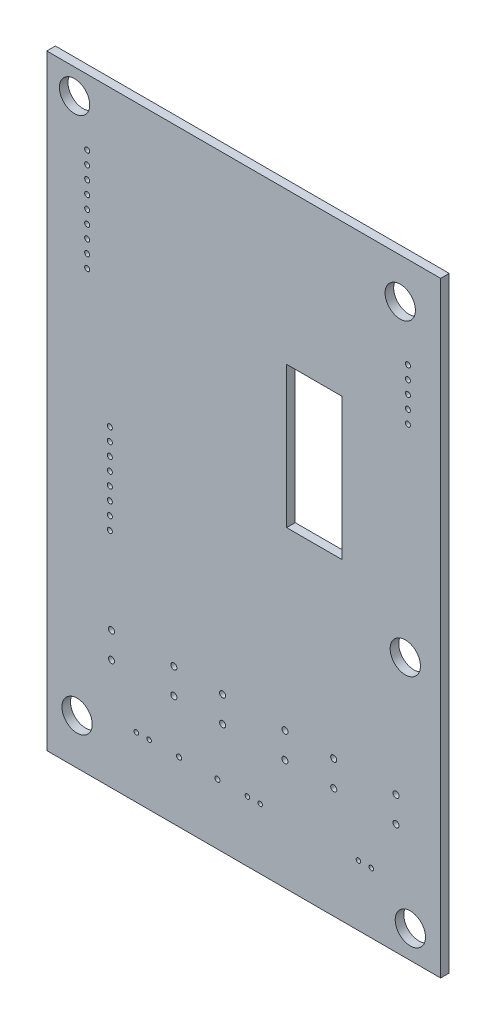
from build123d import *

# Parameters (mm, degrees)
ESQUISSE2_W        = 78
ESQUISSE2_H        = 120
ESQUISSE2_R        = 3
ESQUISSE2_R_2      = 0.5
ESQUISSE2_R_3      = 0.6
ESQUISSE2_R_4      = 0.45
ESQUISSE2_W_2      = 11
ESQUISSE2_H_2      = 28
BOSS_EXTRU_1_DEPTH = 1.7


with BuildPart() as part:
    # Esquisse2 → Boss.-Extru.1 (new body)
    with BuildSketch(Plane.XY):
        with Locations((66, -83)):
            Rectangle(ESQUISSE2_W, ESQUISSE2_H)
        with Locations((97, -31)):
            Circle(ESQUISSE2_R, mode=Mode.SUBTRACT)
        with Locations((98.52, -41.08)):
            Circle(ESQUISSE2_R_2, mode=Mode.SUBTRACT)
        with Locations((98.52, -43.62)):
            Circle(ESQUISSE2_R_2, mode=Mode.SUBTRACT)
        with Locations((98.52, -46.16)):
            Circle(ESQUISSE2_R_2, mode=Mode.SUBTRACT)
        with Locations((98.52, -48.7)):
            Circle(ESQUISSE2_R_2, mode=Mode.SUBTRACT)
        with Locations((98.52, -51.24)):
            Circle(ESQUISSE2_R_2, mode=Mode.SUBTRACT)
        with Locations((32.5, -28)):
            Circle(ESQUISSE2_R, mode=Mode.SUBTRACT)
        with Locations((35, -36)):
            Circle(ESQUISSE2_R_2, mode=Mode.SUBTRACT)
        with Locations((35, -38.54)):
            Circle(ESQUISSE2_R_2, mode=Mode.SUBTRACT)
        with Locations((35, -41.08)):
            Circle(ESQUISSE2_R_2, mode=Mode.SUBTRACT)
        with Locations((35, -43.62)):
            Circle(ESQUISSE2_R_2, mode=Mode.SUBTRACT)
        with Locations((35, -46.16)):
            Circle(ESQUISSE2_R_2, mode=Mode.SUBTRACT)
        with Locations((35, -48.7)):
            Circle(ESQUISSE2_R_2, mode=Mode.SUBTRACT)
        with Locations((35, -51.24)):
            Circle(ESQUISSE2_R_2, mode=Mode.SUBTRACT)
        with Locations((35, -53.78)):
            Circle(ESQUISSE2_R_2, mode=Mode.SUBTRACT)
        with Locations((35, -56.32)):
            Circle(ESQUISSE2_R_2, mode=Mode.SUBTRACT)
        with Locations((39.49, -81.21)):
            Circle(ESQUISSE2_R_2, mode=Mode.SUBTRACT)
        with Locations((98, -91.5)):
            Circle(ESQUISSE2_R, mode=Mode.SUBTRACT)
        with Locations((96.17, -115.96)):
            Circle(ESQUISSE2_R_3, mode=Mode.SUBTRACT)
        with Locations((96.16, -121.04)):
            Circle(ESQUISSE2_R_3, mode=Mode.SUBTRACT)
        with Locations((99, -137.5)):
            Circle(ESQUISSE2_R, mode=Mode.SUBTRACT)
        with Locations((91.265, -131)):
            Circle(ESQUISSE2_R_4, mode=Mode.SUBTRACT)
        with Locations((88.725, -131)):
            Circle(ESQUISSE2_R_4, mode=Mode.SUBTRACT)
        with Locations((83.82, -115.95)):
            Circle(ESQUISSE2_R_3, mode=Mode.SUBTRACT)
        with Locations((83.83, -121.04)):
            Circle(ESQUISSE2_R_3, mode=Mode.SUBTRACT)
        with Locations((74.17, -115.96)):
            Circle(ESQUISSE2_R_3, mode=Mode.SUBTRACT)
        with Locations((74.16, -121.04)):
            Circle(ESQUISSE2_R_3, mode=Mode.SUBTRACT)
        with Locations((69.265, -131)):
            Circle(ESQUISSE2_R_4, mode=Mode.SUBTRACT)
        with Locations((66.725, -131)):
            Circle(ESQUISSE2_R_4, mode=Mode.SUBTRACT)
        with Locations((39.49, -83.75)):
            Circle(ESQUISSE2_R_2, mode=Mode.SUBTRACT)
        with Locations((39.49, -86.29)):
            Circle(ESQUISSE2_R_2, mode=Mode.SUBTRACT)
        with Locations((39.49, -88.83)):
            Circle(ESQUISSE2_R_2, mode=Mode.SUBTRACT)
        with Locations((39.49, -91.37)):
            Circle(ESQUISSE2_R_2, mode=Mode.SUBTRACT)
        with Locations((39.49, -93.91)):
            Circle(ESQUISSE2_R_2, mode=Mode.SUBTRACT)
        with Locations((39.49, -96.45)):
            Circle(ESQUISSE2_R_2, mode=Mode.SUBTRACT)
        with Locations((39.49, -98.99)):
            Circle(ESQUISSE2_R_2, mode=Mode.SUBTRACT)
        with Locations((61.82, -115.95)):
            Circle(ESQUISSE2_R_3, mode=Mode.SUBTRACT)
        with Locations((61.83, -121.04)):
            Circle(ESQUISSE2_R_3, mode=Mode.SUBTRACT)
        with Locations((52.17, -115.96)):
            Circle(ESQUISSE2_R_3, mode=Mode.SUBTRACT)
        with Locations((52.16, -121.04)):
            Circle(ESQUISSE2_R_3, mode=Mode.SUBTRACT)
        with Locations((60.8, -131)):
            Circle(ESQUISSE2_R_2, mode=Mode.SUBTRACT)
        with Locations((53.2, -131)):
            Circle(ESQUISSE2_R_2, mode=Mode.SUBTRACT)
        with Locations((39.82, -115.95)):
            Circle(ESQUISSE2_R_3, mode=Mode.SUBTRACT)
        with Locations((39.83, -121.04)):
            Circle(ESQUISSE2_R_3, mode=Mode.SUBTRACT)
        with Locations((47.265, -131)):
            Circle(ESQUISSE2_R_4, mode=Mode.SUBTRACT)
        with Locations((44.725, -131)):
            Circle(ESQUISSE2_R_4, mode=Mode.SUBTRACT)
        with Locations((33, -134)):
            Circle(ESQUISSE2_R, mode=Mode.SUBTRACT)
        with Locations((80, -67)):
            Rectangle(ESQUISSE2_W_2, ESQUISSE2_H_2, mode=Mode.SUBTRACT)
    extrude(amount=BOSS_EXTRU_1_DEPTH)


solid = part.part
